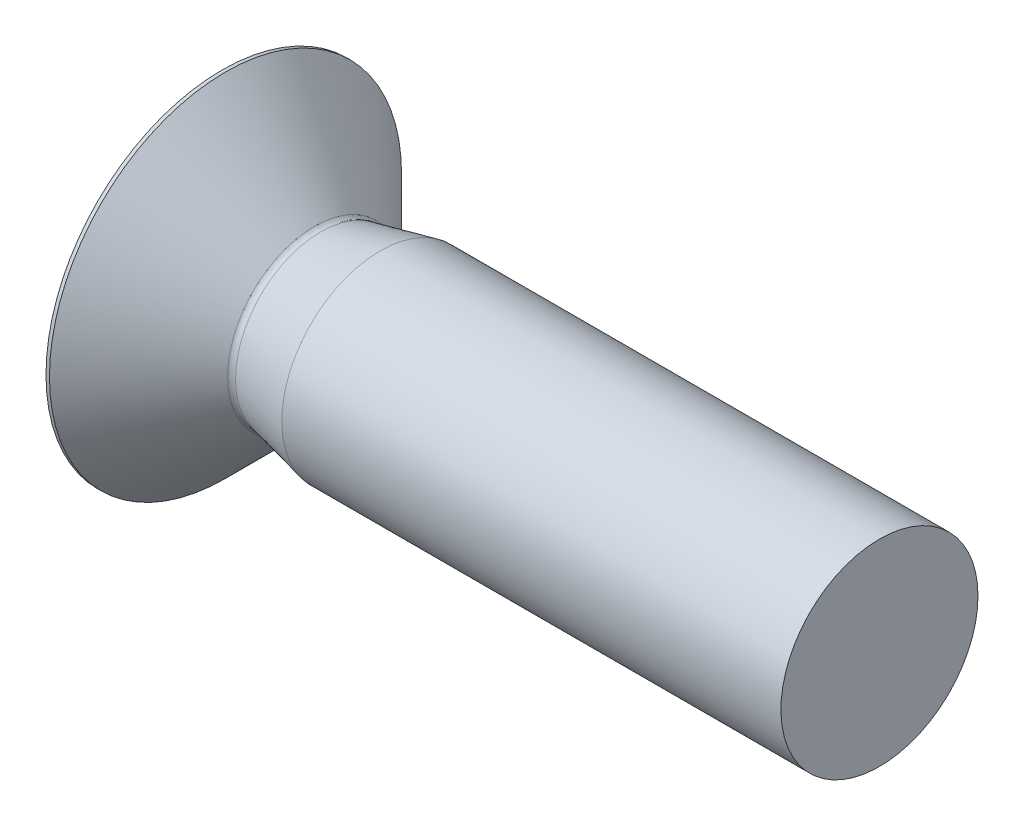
ISO-10303-21;
HEADER;
FILE_DESCRIPTION(('STEP AP214'),'2;1');
FILE_NAME('part.step','',(''),(''),'','','');
FILE_SCHEMA(('AUTOMOTIVE_DESIGN { 1 0 10303 214 1 1 1 1 }'));
ENDSEC;
DATA;
#1=APPLICATION_CONTEXT('core data for automotive mechanical design processes');
#2=APPLICATION_PROTOCOL_DEFINITION('international standard','automotive_design',2000,#1);
#3=PRODUCT_CONTEXT('',#1,'mechanical');
#4=PRODUCT('Part','Part','',(#3));
#5=PRODUCT_RELATED_PRODUCT_CATEGORY('part','',(#4));
#6=PRODUCT_DEFINITION_FORMATION('','',#4);
#7=PRODUCT_DEFINITION_CONTEXT('part definition',#1,'design');
#8=PRODUCT_DEFINITION('design','',#6,#7);
#9=PRODUCT_DEFINITION_SHAPE('','',#8);
#10=(LENGTH_UNIT() NAMED_UNIT(*) SI_UNIT(.MILLI.,.METRE.));
#11=(NAMED_UNIT(*) PLANE_ANGLE_UNIT() SI_UNIT($,.RADIAN.));
#12=(NAMED_UNIT(*) SI_UNIT($,.STERADIAN.) SOLID_ANGLE_UNIT());
#13=UNCERTAINTY_MEASURE_WITH_UNIT(LENGTH_MEASURE(1.E-05),#10,'distance_accuracy_value','');
#14=(GEOMETRIC_REPRESENTATION_CONTEXT(3) GLOBAL_UNCERTAINTY_ASSIGNED_CONTEXT((#13)) GLOBAL_UNIT_ASSIGNED_CONTEXT((#10,
#11,#12)) REPRESENTATION_CONTEXT('',''));
#15=CARTESIAN_POINT('',(0.,0.,0.));
#16=DIRECTION('',(0.,0.,1.));
#17=DIRECTION('',(1.,0.,0.));
#18=AXIS2_PLACEMENT_3D('',#15,#16,#17);
#19=CARTESIAN_POINT('',(13.1071334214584,0.,0.));
#20=DIRECTION('',(0.,0.,1.));
#21=DIRECTION('',(1.,0.,0.));
#22=AXIS2_PLACEMENT_3D('',#19,#20,#21);
#23=SPHERICAL_SURFACE('',#22,13.3871334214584);
#24=CARTESIAN_POINT('',(-0.00899944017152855,0.,0.));
#25=DIRECTION('',(1.,0.,0.));
#26=DIRECTION('',(0.,1.,0.));
#27=AXIS2_PLACEMENT_3D('',#24,#25,#26);
#28=CIRCLE('',#27,2.68);
#29=CARTESIAN_POINT('',(-0.00899944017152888,2.68,0.));
#30=VERTEX_POINT('',#29);
#31=EDGE_CURVE('E131',#30,#30,#28,.F.);
#32=ORIENTED_EDGE('',*,*,#31,.T.);
#33=EDGE_LOOP('',(#32));
#34=FACE_BOUND('',#33,.T.);
#35=CARTESIAN_POINT('',(13.1071334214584,-0.26,0.));
#36=DIRECTION('',(0.,1.,0.));
#37=DIRECTION('',(0.,0.,1.));
#38=AXIS2_PLACEMENT_3D('',#35,#36,#37);
#39=CIRCLE('',#38,13.3846083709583);
#40=CARTESIAN_POINT('',(-0.269568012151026,-0.26,0.46));
#41=VERTEX_POINT('',#40);
#42=CARTESIAN_POINT('',(-0.215301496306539,-0.26,1.28859190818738));
#43=VERTEX_POINT('',#42);
#44=EDGE_CURVE('E146',#41,#43,#39,.T.);
#45=ORIENTED_EDGE('',*,*,#44,.F.);
#46=CARTESIAN_POINT('',(-0.269568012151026,-0.26,0.46));
#47=CARTESIAN_POINT('',(-0.269954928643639,-0.259990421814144,0.448758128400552));
#48=CARTESIAN_POINT('',(-0.270308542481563,-0.260947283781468,0.437517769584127));
#49=CARTESIAN_POINT('',(-0.270940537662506,-0.264724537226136,0.41536078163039));
#50=CARTESIAN_POINT('',(-0.271218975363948,-0.267543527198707,0.404443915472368));
#51=CARTESIAN_POINT('',(-0.271692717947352,-0.274977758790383,0.38323140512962));
#52=CARTESIAN_POINT('',(-0.27188798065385,-0.27959390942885,0.372936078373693));
#53=CARTESIAN_POINT('',(-0.272189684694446,-0.290487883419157,0.353266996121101));
#54=CARTESIAN_POINT('',(-0.272296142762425,-0.296765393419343,0.343893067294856));
#55=CARTESIAN_POINT('',(-0.272417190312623,-0.310800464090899,0.326337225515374));
#56=CARTESIAN_POINT('',(-0.272431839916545,-0.318557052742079,0.318154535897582));
#57=CARTESIAN_POINT('',(-0.272369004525,-0.335334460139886,0.303204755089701));
#58=CARTESIAN_POINT('',(-0.27229150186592,-0.344355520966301,0.296437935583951));
#59=CARTESIAN_POINT('',(-0.272046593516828,-0.363402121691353,0.284514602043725));
#60=CARTESIAN_POINT('',(-0.271879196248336,-0.373427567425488,0.279357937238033));
#61=CARTESIAN_POINT('',(-0.271459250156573,-0.394197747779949,0.270801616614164));
#62=CARTESIAN_POINT('',(-0.271206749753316,-0.404942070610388,0.267400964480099));
#63=CARTESIAN_POINT('',(-0.270722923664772,-0.423125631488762,0.263288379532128));
#64=CARTESIAN_POINT('',(-0.270513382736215,-0.430451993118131,0.262055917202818));
#65=CARTESIAN_POINT('',(-0.270063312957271,-0.445184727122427,0.26041182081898));
#66=CARTESIAN_POINT('',(-0.269822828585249,-0.452590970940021,0.259999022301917));
#67=CARTESIAN_POINT('',(-0.26956801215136,-0.459999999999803,0.259999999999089));
#68=B_SPLINE_CURVE_WITH_KNOTS('',3,(#46,#47,#48,#49,#50,#51,#52,#53,#54,#55,#56,#57,#58,#59,#60,
#61,#62,#63,#64,#65,#66,#67),.UNSPECIFIED.,.F.,.F.,(4,2,2,2,2,2,2,2,2,2,4),(0.,
0.0337011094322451,0.0673768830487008,0.101069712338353,0.134756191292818,0.168420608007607,
0.202091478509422,0.23575919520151,0.269407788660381,0.291661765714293,0.313884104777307),.UNSPECIFIED.);
#69=CARTESIAN_POINT('',(-0.269568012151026,-0.46,0.26));
#70=VERTEX_POINT('',#69);
#71=EDGE_CURVE('E221',#41,#70,#68,.T.);
#72=ORIENTED_EDGE('',*,*,#71,.T.);
#73=CARTESIAN_POINT('',(13.1071334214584,0.,0.26));
#74=DIRECTION('',(0.,0.,-1.));
#75=DIRECTION('',(0.,1.,0.));
#76=AXIS2_PLACEMENT_3D('',#73,#74,#75);
#77=CIRCLE('',#76,13.3846083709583);
#78=CARTESIAN_POINT('',(-0.215301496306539,-1.28859190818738,0.26));
#79=VERTEX_POINT('',#78);
#80=EDGE_CURVE('E184',#79,#70,#77,.T.);
#81=ORIENTED_EDGE('',*,*,#80,.F.);
#82=CARTESIAN_POINT('',(12.9257750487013,1.02853444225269,0.));
#83=DIRECTION('',(-0.173648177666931,0.984807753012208,0.));
#84=DIRECTION('',(-0.984807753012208,-0.173648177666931,0.));
#85=AXIS2_PLACEMENT_3D('',#82,#83,#84);
#86=CIRCLE('',#85,13.3463316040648);
#87=CARTESIAN_POINT('',(-0.215301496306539,-1.28859190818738,-0.260000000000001));
#88=VERTEX_POINT('',#87);
#89=EDGE_CURVE('E182',#88,#79,#86,.T.);
#90=ORIENTED_EDGE('',*,*,#89,.F.);
#91=CARTESIAN_POINT('',(13.1071334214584,0.,-0.26));
#92=DIRECTION('',(0.,0.,1.));
#93=DIRECTION('',(0.,-1.,0.));
#94=AXIS2_PLACEMENT_3D('',#91,#92,#93);
#95=CIRCLE('',#94,13.3846083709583);
#96=CARTESIAN_POINT('',(-0.269568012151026,-0.46,-0.260000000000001));
#97=VERTEX_POINT('',#96);
#98=EDGE_CURVE('E185',#97,#88,#95,.T.);
#99=ORIENTED_EDGE('',*,*,#98,.F.);
#100=CARTESIAN_POINT('',(-0.269568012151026,-0.46,-0.26));
#101=CARTESIAN_POINT('',(-0.269954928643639,-0.448758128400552,-0.259990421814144));
#102=CARTESIAN_POINT('',(-0.270308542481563,-0.437517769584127,-0.260947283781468));
#103=CARTESIAN_POINT('',(-0.270940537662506,-0.41536078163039,-0.264724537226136));
#104=CARTESIAN_POINT('',(-0.271218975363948,-0.404443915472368,-0.267543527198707));
#105=CARTESIAN_POINT('',(-0.271692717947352,-0.38323140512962,-0.274977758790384));
#106=CARTESIAN_POINT('',(-0.27188798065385,-0.372936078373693,-0.279593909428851));
#107=CARTESIAN_POINT('',(-0.272189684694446,-0.353266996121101,-0.290487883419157));
#108=CARTESIAN_POINT('',(-0.272296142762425,-0.343893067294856,-0.296765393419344));
#109=CARTESIAN_POINT('',(-0.272417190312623,-0.326337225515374,-0.310800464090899));
#110=CARTESIAN_POINT('',(-0.272431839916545,-0.318154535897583,-0.31855705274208));
#111=CARTESIAN_POINT('',(-0.272369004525,-0.303204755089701,-0.335334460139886));
#112=CARTESIAN_POINT('',(-0.27229150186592,-0.296437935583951,-0.344355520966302));
#113=CARTESIAN_POINT('',(-0.272046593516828,-0.284514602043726,-0.363402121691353));
#114=CARTESIAN_POINT('',(-0.271879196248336,-0.279357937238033,-0.373427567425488));
#115=CARTESIAN_POINT('',(-0.271459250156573,-0.270801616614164,-0.39419774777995));
#116=CARTESIAN_POINT('',(-0.271206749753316,-0.267400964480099,-0.404942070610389));
#117=CARTESIAN_POINT('',(-0.270722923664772,-0.263288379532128,-0.423125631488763));
#118=CARTESIAN_POINT('',(-0.270513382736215,-0.262055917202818,-0.430451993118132));
#119=CARTESIAN_POINT('',(-0.270063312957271,-0.26041182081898,-0.445184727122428));
#120=CARTESIAN_POINT('',(-0.269822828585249,-0.259999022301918,-0.452590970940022));
#121=CARTESIAN_POINT('',(-0.26956801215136,-0.25999999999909,-0.459999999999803));
#122=B_SPLINE_CURVE_WITH_KNOTS('',3,(#100,#101,#102,#103,#104,#105,#106,#107,#108,#109,#110,
#111,#112,#113,#114,#115,#116,#117,#118,#119,#120,#121),.UNSPECIFIED.,.F.,.F.,(4,2,2,2,2,2,2,2,
2,2,4),(0.,0.0337011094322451,0.0673768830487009,0.101069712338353,0.134756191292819,
0.168420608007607,0.202091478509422,0.23575919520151,0.269407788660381,0.291661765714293,
0.313884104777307),.UNSPECIFIED.);
#123=CARTESIAN_POINT('',(-0.269568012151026,-0.26,-0.46));
#124=VERTEX_POINT('',#123);
#125=EDGE_CURVE('E229',#97,#124,#122,.T.);
#126=ORIENTED_EDGE('',*,*,#125,.T.);
#127=CARTESIAN_POINT('',(13.1071334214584,-0.26,0.));
#128=DIRECTION('',(0.,1.,0.));
#129=DIRECTION('',(0.,0.,1.));
#130=AXIS2_PLACEMENT_3D('',#127,#128,#129);
#131=CIRCLE('',#130,13.3846083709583);
#132=CARTESIAN_POINT('',(-0.215301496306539,-0.26,-1.28859190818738));
#133=VERTEX_POINT('',#132);
#134=EDGE_CURVE('E161',#133,#124,#131,.T.);
#135=ORIENTED_EDGE('',*,*,#134,.F.);
#136=CARTESIAN_POINT('',(12.9257750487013,0.,1.02853444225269));
#137=DIRECTION('',(-0.173648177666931,0.,0.984807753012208));
#138=DIRECTION('',(0.984807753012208,0.,0.173648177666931));
#139=AXIS2_PLACEMENT_3D('',#136,#137,#138);
#140=CIRCLE('',#139,13.3463316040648);
#141=CARTESIAN_POINT('',(-0.215301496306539,0.26,-1.28859190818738));
#142=VERTEX_POINT('',#141);
#143=EDGE_CURVE('E159',#142,#133,#140,.T.);
#144=ORIENTED_EDGE('',*,*,#143,.F.);
#145=CARTESIAN_POINT('',(13.1071334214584,0.26,0.));
#146=DIRECTION('',(0.,-1.,0.));
#147=DIRECTION('',(0.,0.,-1.));
#148=AXIS2_PLACEMENT_3D('',#145,#146,#147);
#149=CIRCLE('',#148,13.3846083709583);
#150=CARTESIAN_POINT('',(-0.269568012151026,0.26,-0.46));
#151=VERTEX_POINT('',#150);
#152=EDGE_CURVE('E162',#151,#142,#149,.T.);
#153=ORIENTED_EDGE('',*,*,#152,.F.);
#154=CARTESIAN_POINT('',(-0.269568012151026,0.26,-0.46));
#155=CARTESIAN_POINT('',(-0.269954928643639,0.259990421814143,-0.448758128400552));
#156=CARTESIAN_POINT('',(-0.270308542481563,0.260947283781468,-0.437517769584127));
#157=CARTESIAN_POINT('',(-0.270940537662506,0.264724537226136,-0.41536078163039));
#158=CARTESIAN_POINT('',(-0.271218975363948,0.267543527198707,-0.404443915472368));
#159=CARTESIAN_POINT('',(-0.271692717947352,0.274977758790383,-0.38323140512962));
#160=CARTESIAN_POINT('',(-0.27188798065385,0.27959390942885,-0.372936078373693));
#161=CARTESIAN_POINT('',(-0.272189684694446,0.290487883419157,-0.353266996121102));
#162=CARTESIAN_POINT('',(-0.272296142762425,0.296765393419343,-0.343893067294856));
#163=CARTESIAN_POINT('',(-0.272417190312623,0.310800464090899,-0.326337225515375));
#164=CARTESIAN_POINT('',(-0.272431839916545,0.31855705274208,-0.318154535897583));
#165=CARTESIAN_POINT('',(-0.272369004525,0.335334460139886,-0.303204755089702));
#166=CARTESIAN_POINT('',(-0.27229150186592,0.344355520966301,-0.296437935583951));
#167=CARTESIAN_POINT('',(-0.272046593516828,0.363402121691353,-0.284514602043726));
#168=CARTESIAN_POINT('',(-0.271879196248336,0.373427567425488,-0.279357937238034));
#169=CARTESIAN_POINT('',(-0.271459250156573,0.39419774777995,-0.270801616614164));
#170=CARTESIAN_POINT('',(-0.271206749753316,0.404942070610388,-0.267400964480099));
#171=CARTESIAN_POINT('',(-0.270722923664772,0.423125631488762,-0.263288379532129));
#172=CARTESIAN_POINT('',(-0.270513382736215,0.430451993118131,-0.262055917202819));
#173=CARTESIAN_POINT('',(-0.270063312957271,0.445184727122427,-0.260411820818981));
#174=CARTESIAN_POINT('',(-0.26982282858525,0.452590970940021,-0.259999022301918));
#175=CARTESIAN_POINT('',(-0.26956801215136,0.459999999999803,-0.25999999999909));
#176=B_SPLINE_CURVE_WITH_KNOTS('',3,(#154,#155,#156,#157,#158,#159,#160,#161,#162,#163,#164,
#165,#166,#167,#168,#169,#170,#171,#172,#173,#174,#175),.UNSPECIFIED.,.F.,.F.,(4,2,2,2,2,2,2,2,
2,2,4),(0.,0.0337011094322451,0.0673768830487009,0.101069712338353,0.134756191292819,
0.168420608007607,0.202091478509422,0.23575919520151,0.269407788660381,0.291661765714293,
0.313884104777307),.UNSPECIFIED.);
#177=CARTESIAN_POINT('',(-0.269568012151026,0.46,-0.26));
#178=VERTEX_POINT('',#177);
#179=EDGE_CURVE('E246',#151,#178,#176,.T.);
#180=ORIENTED_EDGE('',*,*,#179,.T.);
#181=CARTESIAN_POINT('',(13.1071334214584,0.,-0.260000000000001));
#182=DIRECTION('',(0.,0.,1.));
#183=DIRECTION('',(0.,-1.,0.));
#184=AXIS2_PLACEMENT_3D('',#181,#182,#183);
#185=CIRCLE('',#184,13.3846083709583);
#186=CARTESIAN_POINT('',(-0.215301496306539,1.28859190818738,-0.26));
#187=VERTEX_POINT('',#186);
#188=EDGE_CURVE('E173',#187,#178,#185,.T.);
#189=ORIENTED_EDGE('',*,*,#188,.F.);
#190=CARTESIAN_POINT('',(12.9257750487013,-1.02853444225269,0.));
#191=DIRECTION('',(-0.173648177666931,-0.984807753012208,0.));
#192=DIRECTION('',(0.984807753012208,-0.173648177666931,0.));
#193=AXIS2_PLACEMENT_3D('',#190,#191,#192);
#194=CIRCLE('',#193,13.3463316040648);
#195=CARTESIAN_POINT('',(-0.215301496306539,1.28859190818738,0.26));
#196=VERTEX_POINT('',#195);
#197=EDGE_CURVE('E171',#196,#187,#194,.T.);
#198=ORIENTED_EDGE('',*,*,#197,.F.);
#199=CARTESIAN_POINT('',(13.1071334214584,0.,0.26));
#200=DIRECTION('',(0.,0.,-1.));
#201=DIRECTION('',(0.,1.,0.));
#202=AXIS2_PLACEMENT_3D('',#199,#200,#201);
#203=CIRCLE('',#202,13.3846083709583);
#204=CARTESIAN_POINT('',(-0.269568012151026,0.46,0.26));
#205=VERTEX_POINT('',#204);
#206=EDGE_CURVE('E187',#205,#196,#203,.T.);
#207=ORIENTED_EDGE('',*,*,#206,.F.);
#208=CARTESIAN_POINT('',(-0.269568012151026,0.46,0.26));
#209=CARTESIAN_POINT('',(-0.269954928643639,0.448758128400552,0.259990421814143));
#210=CARTESIAN_POINT('',(-0.270308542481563,0.437517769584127,0.260947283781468));
#211=CARTESIAN_POINT('',(-0.270940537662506,0.41536078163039,0.264724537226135));
#212=CARTESIAN_POINT('',(-0.271218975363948,0.404443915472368,0.267543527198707));
#213=CARTESIAN_POINT('',(-0.271692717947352,0.38323140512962,0.274977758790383));
#214=CARTESIAN_POINT('',(-0.27188798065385,0.372936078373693,0.27959390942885));
#215=CARTESIAN_POINT('',(-0.272189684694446,0.353266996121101,0.290487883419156));
#216=CARTESIAN_POINT('',(-0.272296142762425,0.343893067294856,0.296765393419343));
#217=CARTESIAN_POINT('',(-0.272417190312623,0.326337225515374,0.310800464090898));
#218=CARTESIAN_POINT('',(-0.272431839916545,0.318154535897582,0.318557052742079));
#219=CARTESIAN_POINT('',(-0.272369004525,0.303204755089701,0.335334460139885));
#220=CARTESIAN_POINT('',(-0.27229150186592,0.296437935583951,0.344355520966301));
#221=CARTESIAN_POINT('',(-0.272046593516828,0.284514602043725,0.363402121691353));
#222=CARTESIAN_POINT('',(-0.271879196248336,0.279357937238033,0.373427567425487));
#223=CARTESIAN_POINT('',(-0.271459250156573,0.270801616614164,0.394197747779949));
#224=CARTESIAN_POINT('',(-0.271206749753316,0.267400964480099,0.404942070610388));
#225=CARTESIAN_POINT('',(-0.270722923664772,0.263288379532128,0.423125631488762));
#226=CARTESIAN_POINT('',(-0.270513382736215,0.262055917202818,0.430451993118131));
#227=CARTESIAN_POINT('',(-0.270063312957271,0.26041182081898,0.445184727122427));
#228=CARTESIAN_POINT('',(-0.269822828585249,0.259999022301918,0.452590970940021));
#229=CARTESIAN_POINT('',(-0.26956801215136,0.25999999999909,0.459999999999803));
#230=B_SPLINE_CURVE_WITH_KNOTS('',3,(#208,#209,#210,#211,#212,#213,#214,#215,#216,#217,#218,
#219,#220,#221,#222,#223,#224,#225,#226,#227,#228,#229),.UNSPECIFIED.,.F.,.F.,(4,2,2,2,2,2,2,2,
2,2,4),(0.,0.0337011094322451,0.0673768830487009,0.101069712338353,0.134756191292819,
0.168420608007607,0.202091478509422,0.23575919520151,0.269407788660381,0.291661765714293,
0.313884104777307),.UNSPECIFIED.);
#231=CARTESIAN_POINT('',(-0.269568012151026,0.26,0.46));
#232=VERTEX_POINT('',#231);
#233=EDGE_CURVE('E253',#205,#232,#230,.T.);
#234=ORIENTED_EDGE('',*,*,#233,.T.);
#235=CARTESIAN_POINT('',(13.1071334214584,0.26,0.));
#236=DIRECTION('',(0.,-1.,0.));
#237=DIRECTION('',(0.,0.,-1.));
#238=AXIS2_PLACEMENT_3D('',#235,#236,#237);
#239=CIRCLE('',#238,13.3846083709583);
#240=CARTESIAN_POINT('',(-0.215301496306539,0.26,1.28859190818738));
#241=VERTEX_POINT('',#240);
#242=EDGE_CURVE('E145',#241,#232,#239,.T.);
#243=ORIENTED_EDGE('',*,*,#242,.F.);
#244=CARTESIAN_POINT('',(12.9257750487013,0.,-1.02853444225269));
#245=DIRECTION('',(-0.173648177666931,0.,-0.984807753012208));
#246=DIRECTION('',(-0.984807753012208,0.,0.173648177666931));
#247=AXIS2_PLACEMENT_3D('',#244,#245,#246);
#248=CIRCLE('',#247,13.3463316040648);
#249=EDGE_CURVE('E130',#43,#241,#248,.T.);
#250=ORIENTED_EDGE('',*,*,#249,.F.);
#251=EDGE_LOOP('',(#45,#72,#81,#90,#99,#126,#135,#144,#153,#180,#189,#198,#207,#234,#243,#250));
#252=FACE_BOUND('',#251,.T.);
#253=ADVANCED_FACE('F38',(#34,#252),#23,.T.);
#254=CARTESIAN_POINT('',(1.4,0.,0.));
#255=DIRECTION('',(-1.,0.,0.));
#256=DIRECTION('',(0.,1.,0.));
#257=AXIS2_PLACEMENT_3D('',#254,#255,#256);
#258=CONICAL_SURFACE('',#257,1.32367301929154,0.78539816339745);
#259=CARTESIAN_POINT('',(0.0436730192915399,0.,0.));
#260=DIRECTION('',(-1.,0.,0.));
#261=DIRECTION('',(0.,0.,1.));
#262=AXIS2_PLACEMENT_3D('',#259,#260,#261);
#263=CIRCLE('',#262,2.68);
#264=CARTESIAN_POINT('',(0.0436730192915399,0.,2.68));
#265=VERTEX_POINT('',#264);
#266=EDGE_CURVE('E332',#265,#265,#263,.F.);
#267=ORIENTED_EDGE('',*,*,#266,.T.);
#268=EDGE_LOOP('',(#267));
#269=FACE_BOUND('',#268,.T.);
#270=CARTESIAN_POINT('',(1.4,0.,0.));
#271=DIRECTION('',(-1.,0.,0.));
#272=DIRECTION('',(0.,0.,1.));
#273=AXIS2_PLACEMENT_3D('',#270,#271,#272);
#274=CIRCLE('',#273,1.32367301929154);
#275=CARTESIAN_POINT('',(1.4,0.,1.32367301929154));
#276=VERTEX_POINT('',#275);
#277=EDGE_CURVE('E421',#276,#276,#274,.T.);
#278=ORIENTED_EDGE('',*,*,#277,.T.);
#279=EDGE_LOOP('',(#278));
#280=FACE_BOUND('',#279,.T.);
#281=ADVANCED_FACE('F240',(#269,#280),#258,.T.);
#282=CARTESIAN_POINT('',(10.,0.,0.));
#283=DIRECTION('',(1.,0.,0.));
#284=DIRECTION('',(0.,1.,0.));
#285=AXIS2_PLACEMENT_3D('',#282,#283,#284);
#286=CYLINDRICAL_SURFACE('',#285,2.68);
#287=ORIENTED_EDGE('',*,*,#31,.F.);
#288=EDGE_LOOP('',(#287));
#289=FACE_BOUND('',#288,.T.);
#290=ORIENTED_EDGE('',*,*,#266,.F.);
#291=EDGE_LOOP('',(#290));
#292=FACE_BOUND('',#291,.T.);
#293=ADVANCED_FACE('F398',(#289,#292),#286,.T.);
#294=CARTESIAN_POINT('',(1.12,1.3,0.26));
#295=DIRECTION('',(0.,0.,-1.));
#296=DIRECTION('',(0.,1.,0.));
#297=AXIS2_PLACEMENT_3D('',#294,#295,#296);
#298=PLANE('',#297);
#299=DIRECTION('',(0.,-1.,0.));
#300=VECTOR('',#299,1.);
#301=CARTESIAN_POINT('',(1.12,1.3,0.26));
#302=LINE('',#301,#300);
#303=CARTESIAN_POINT('',(1.12,1.05314222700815,0.26));
#304=VERTEX_POINT('',#303);
#305=CARTESIAN_POINT('',(1.12,0.46,0.26));
#306=VERTEX_POINT('',#305);
#307=EDGE_CURVE('E122',#304,#306,#302,.T.);
#308=ORIENTED_EDGE('',*,*,#307,.T.);
#309=DIRECTION('',(-1.,0.,0.));
#310=VECTOR('',#309,1.);
#311=CARTESIAN_POINT('',(1.12,0.46,0.26));
#312=LINE('',#311,#310);
#313=EDGE_CURVE('E209',#306,#205,#312,.T.);
#314=ORIENTED_EDGE('',*,*,#313,.T.);
#315=ORIENTED_EDGE('',*,*,#206,.T.);
#316=DIRECTION('',(-0.984807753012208,0.173648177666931,0.));
#317=VECTOR('',#316,1.);
#318=CARTESIAN_POINT('',(1.07778483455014,1.06058589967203,0.26));
#319=LINE('',#318,#317);
#320=EDGE_CURVE('E165',#304,#196,#319,.T.);
#321=ORIENTED_EDGE('',*,*,#320,.F.);
#322=EDGE_LOOP('',(#308,#314,#315,#321));
#323=FACE_BOUND('',#322,.T.);
#324=ADVANCED_FACE('F365',(#323),#298,.T.);
#325=CARTESIAN_POINT('',(1.12,0.26,1.3));
#326=DIRECTION('',(0.,-1.,0.));
#327=DIRECTION('',(0.,0.,-1.));
#328=AXIS2_PLACEMENT_3D('',#325,#326,#327);
#329=PLANE('',#328);
#330=ORIENTED_EDGE('',*,*,#242,.T.);
#331=DIRECTION('',(-1.,0.,0.));
#332=VECTOR('',#331,1.);
#333=CARTESIAN_POINT('',(1.12,0.26,0.46));
#334=LINE('',#333,#332);
#335=CARTESIAN_POINT('',(1.12,0.26,0.46));
#336=VERTEX_POINT('',#335);
#337=EDGE_CURVE('E116',#232,#336,#334,.F.);
#338=ORIENTED_EDGE('',*,*,#337,.T.);
#339=DIRECTION('',(0.,0.,1.));
#340=VECTOR('',#339,1.);
#341=CARTESIAN_POINT('',(1.12,0.26,1.3));
#342=LINE('',#341,#340);
#343=CARTESIAN_POINT('',(1.12,0.26,1.05314222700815));
#344=VERTEX_POINT('',#343);
#345=EDGE_CURVE('E110',#336,#344,#342,.T.);
#346=ORIENTED_EDGE('',*,*,#345,.T.);
#347=DIRECTION('',(-0.984807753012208,0.,0.173648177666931));
#348=VECTOR('',#347,1.);
#349=CARTESIAN_POINT('',(-0.28,0.26,1.3));
#350=LINE('',#349,#348);
#351=EDGE_CURVE('E42',#344,#241,#350,.T.);
#352=ORIENTED_EDGE('',*,*,#351,.T.);
#353=EDGE_LOOP('',(#330,#338,#346,#352));
#354=FACE_BOUND('',#353,.T.);
#355=ADVANCED_FACE('F113',(#354),#329,.T.);
#356=CARTESIAN_POINT('',(-0.28,0.,1.3));
#357=DIRECTION('',(-0.173648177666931,0.,-0.984807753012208));
#358=DIRECTION('',(-0.984807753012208,0.,0.173648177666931));
#359=AXIS2_PLACEMENT_3D('',#356,#357,#358);
#360=PLANE('',#359);
#361=ORIENTED_EDGE('',*,*,#249,.T.);
#362=ORIENTED_EDGE('',*,*,#351,.F.);
#363=DIRECTION('',(0.,-1.,0.));
#364=VECTOR('',#363,1.);
#365=CARTESIAN_POINT('',(1.12,0.,1.05314222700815));
#366=LINE('',#365,#364);
#367=CARTESIAN_POINT('',(1.12,-0.26,1.05314222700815));
#368=VERTEX_POINT('',#367);
#369=EDGE_CURVE('E121',#344,#368,#366,.T.);
#370=ORIENTED_EDGE('',*,*,#369,.T.);
#371=DIRECTION('',(-0.984807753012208,0.,0.173648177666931));
#372=VECTOR('',#371,1.);
#373=CARTESIAN_POINT('',(1.07778483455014,-0.26,1.06058589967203));
#374=LINE('',#373,#372);
#375=EDGE_CURVE('E132',#368,#43,#374,.T.);
#376=ORIENTED_EDGE('',*,*,#375,.T.);
#377=EDGE_LOOP('',(#361,#362,#370,#376));
#378=FACE_BOUND('',#377,.T.);
#379=ADVANCED_FACE('F126',(#378),#360,.T.);
#380=CARTESIAN_POINT('',(1.12,-0.26,1.3));
#381=DIRECTION('',(0.,1.,0.));
#382=DIRECTION('',(0.,0.,1.));
#383=AXIS2_PLACEMENT_3D('',#380,#381,#382);
#384=PLANE('',#383);
#385=DIRECTION('',(0.,0.,-1.));
#386=VECTOR('',#385,1.);
#387=CARTESIAN_POINT('',(1.12,-0.26,1.3));
#388=LINE('',#387,#386);
#389=CARTESIAN_POINT('',(1.12,-0.26,0.46));
#390=VERTEX_POINT('',#389);
#391=EDGE_CURVE('E138',#368,#390,#388,.T.);
#392=ORIENTED_EDGE('',*,*,#391,.T.);
#393=DIRECTION('',(-1.,0.,0.));
#394=VECTOR('',#393,1.);
#395=CARTESIAN_POINT('',(1.12,-0.26,0.46));
#396=LINE('',#395,#394);
#397=EDGE_CURVE('E194',#390,#41,#396,.T.);
#398=ORIENTED_EDGE('',*,*,#397,.T.);
#399=ORIENTED_EDGE('',*,*,#44,.T.);
#400=ORIENTED_EDGE('',*,*,#375,.F.);
#401=EDGE_LOOP('',(#392,#398,#399,#400));
#402=FACE_BOUND('',#401,.T.);
#403=ADVANCED_FACE('F278',(#402),#384,.T.);
#404=CARTESIAN_POINT('',(1.12,-0.26,0.26));
#405=DIRECTION('',(0.,0.,-1.));
#406=DIRECTION('',(0.,1.,0.));
#407=AXIS2_PLACEMENT_3D('',#404,#405,#406);
#408=PLANE('',#407);
#409=ORIENTED_EDGE('',*,*,#80,.T.);
#410=DIRECTION('',(-1.,0.,0.));
#411=VECTOR('',#410,1.);
#412=CARTESIAN_POINT('',(1.12,-0.46,0.26));
#413=LINE('',#412,#411);
#414=CARTESIAN_POINT('',(1.12,-0.46,0.26));
#415=VERTEX_POINT('',#414);
#416=EDGE_CURVE('E218',#70,#415,#413,.F.);
#417=ORIENTED_EDGE('',*,*,#416,.T.);
#418=DIRECTION('',(0.,-1.,0.));
#419=VECTOR('',#418,1.);
#420=CARTESIAN_POINT('',(1.12,-0.26,0.26));
#421=LINE('',#420,#419);
#422=CARTESIAN_POINT('',(1.12,-1.05314222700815,0.26));
#423=VERTEX_POINT('',#422);
#424=EDGE_CURVE('E139',#415,#423,#421,.T.);
#425=ORIENTED_EDGE('',*,*,#424,.T.);
#426=DIRECTION('',(-0.984807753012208,-0.173648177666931,0.));
#427=VECTOR('',#426,1.);
#428=CARTESIAN_POINT('',(-0.28,-1.3,0.26));
#429=LINE('',#428,#427);
#430=EDGE_CURVE('E143',#423,#79,#429,.T.);
#431=ORIENTED_EDGE('',*,*,#430,.T.);
#432=EDGE_LOOP('',(#409,#417,#425,#431));
#433=FACE_BOUND('',#432,.T.);
#434=ADVANCED_FACE('F275',(#433),#408,.T.);
#435=CARTESIAN_POINT('',(-0.28,-1.3,0.));
#436=DIRECTION('',(-0.173648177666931,0.984807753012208,0.));
#437=DIRECTION('',(-0.984807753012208,-0.173648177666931,0.));
#438=AXIS2_PLACEMENT_3D('',#435,#436,#437);
#439=PLANE('',#438);
#440=ORIENTED_EDGE('',*,*,#89,.T.);
#441=ORIENTED_EDGE('',*,*,#430,.F.);
#442=DIRECTION('',(0.,0.,-1.));
#443=VECTOR('',#442,1.);
#444=CARTESIAN_POINT('',(1.12,-1.05314222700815,0.));
#445=LINE('',#444,#443);
#446=CARTESIAN_POINT('',(1.12,-1.05314222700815,-0.260000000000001));
#447=VERTEX_POINT('',#446);
#448=EDGE_CURVE('E177',#423,#447,#445,.T.);
#449=ORIENTED_EDGE('',*,*,#448,.T.);
#450=DIRECTION('',(-0.984807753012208,-0.173648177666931,0.));
#451=VECTOR('',#450,1.);
#452=CARTESIAN_POINT('',(1.25563530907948,-1.0292260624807,-0.260000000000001));
#453=LINE('',#452,#451);
#454=EDGE_CURVE('E150',#447,#88,#453,.T.);
#455=ORIENTED_EDGE('',*,*,#454,.T.);
#456=EDGE_LOOP('',(#440,#441,#449,#455));
#457=FACE_BOUND('',#456,.T.);
#458=ADVANCED_FACE('F271',(#457),#439,.T.);
#459=CARTESIAN_POINT('',(1.12,-0.26,-0.26));
#460=DIRECTION('',(0.,0.,1.));
#461=DIRECTION('',(0.,-1.,0.));
#462=AXIS2_PLACEMENT_3D('',#459,#460,#461);
#463=PLANE('',#462);
#464=DIRECTION('',(0.,1.,0.));
#465=VECTOR('',#464,1.);
#466=CARTESIAN_POINT('',(1.12,-0.26,-0.26));
#467=LINE('',#466,#465);
#468=CARTESIAN_POINT('',(1.12,-0.46,-0.26));
#469=VERTEX_POINT('',#468);
#470=EDGE_CURVE('E179',#447,#469,#467,.T.);
#471=ORIENTED_EDGE('',*,*,#470,.T.);
#472=DIRECTION('',(-1.,0.,0.));
#473=VECTOR('',#472,1.);
#474=CARTESIAN_POINT('',(1.12,-0.46,-0.26));
#475=LINE('',#474,#473);
#476=EDGE_CURVE('E215',#469,#97,#475,.T.);
#477=ORIENTED_EDGE('',*,*,#476,.T.);
#478=ORIENTED_EDGE('',*,*,#98,.T.);
#479=ORIENTED_EDGE('',*,*,#454,.F.);
#480=EDGE_LOOP('',(#471,#477,#478,#479));
#481=FACE_BOUND('',#480,.T.);
#482=ADVANCED_FACE('F274',(#481),#463,.T.);
#483=CARTESIAN_POINT('',(1.12,-0.26,-0.26));
#484=DIRECTION('',(0.,1.,0.));
#485=DIRECTION('',(0.,0.,1.));
#486=AXIS2_PLACEMENT_3D('',#483,#484,#485);
#487=PLANE('',#486);
#488=ORIENTED_EDGE('',*,*,#134,.T.);
#489=DIRECTION('',(-1.,0.,0.));
#490=VECTOR('',#489,1.);
#491=CARTESIAN_POINT('',(1.12,-0.26,-0.46));
#492=LINE('',#491,#490);
#493=CARTESIAN_POINT('',(1.12,-0.26,-0.46));
#494=VERTEX_POINT('',#493);
#495=EDGE_CURVE('E212',#124,#494,#492,.F.);
#496=ORIENTED_EDGE('',*,*,#495,.T.);
#497=DIRECTION('',(0.,0.,-1.));
#498=VECTOR('',#497,1.);
#499=CARTESIAN_POINT('',(1.12,-0.26,-0.26));
#500=LINE('',#499,#498);
#501=CARTESIAN_POINT('',(1.12,-0.26,-1.05314222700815));
#502=VERTEX_POINT('',#501);
#503=EDGE_CURVE('E155',#494,#502,#500,.T.);
#504=ORIENTED_EDGE('',*,*,#503,.T.);
#505=DIRECTION('',(-0.984807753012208,0.,-0.173648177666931));
#506=VECTOR('',#505,1.);
#507=CARTESIAN_POINT('',(-0.28,-0.26,-1.3));
#508=LINE('',#507,#506);
#509=EDGE_CURVE('E147',#502,#133,#508,.T.);
#510=ORIENTED_EDGE('',*,*,#509,.T.);
#511=EDGE_LOOP('',(#488,#496,#504,#510));
#512=FACE_BOUND('',#511,.T.);
#513=ADVANCED_FACE('F282',(#512),#487,.T.);
#514=CARTESIAN_POINT('',(-0.28,0.,-1.3));
#515=DIRECTION('',(-0.173648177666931,0.,0.984807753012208));
#516=DIRECTION('',(0.984807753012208,0.,0.173648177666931));
#517=AXIS2_PLACEMENT_3D('',#514,#515,#516);
#518=PLANE('',#517);
#519=ORIENTED_EDGE('',*,*,#143,.T.);
#520=ORIENTED_EDGE('',*,*,#509,.F.);
#521=DIRECTION('',(0.,1.,0.));
#522=VECTOR('',#521,1.);
#523=CARTESIAN_POINT('',(1.12,0.,-1.05314222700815));
#524=LINE('',#523,#522);
#525=CARTESIAN_POINT('',(1.12,0.26,-1.05314222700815));
#526=VERTEX_POINT('',#525);
#527=EDGE_CURVE('E152',#502,#526,#524,.T.);
#528=ORIENTED_EDGE('',*,*,#527,.T.);
#529=DIRECTION('',(-0.984807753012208,0.,-0.173648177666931));
#530=VECTOR('',#529,1.);
#531=CARTESIAN_POINT('',(1.25563530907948,0.26,-1.0292260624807));
#532=LINE('',#531,#530);
#533=EDGE_CURVE('E151',#526,#142,#532,.T.);
#534=ORIENTED_EDGE('',*,*,#533,.T.);
#535=EDGE_LOOP('',(#519,#520,#528,#534));
#536=FACE_BOUND('',#535,.T.);
#537=ADVANCED_FACE('F279',(#536),#518,.T.);
#538=CARTESIAN_POINT('',(1.12,0.26,-0.26));
#539=DIRECTION('',(0.,-1.,0.));
#540=DIRECTION('',(0.,0.,-1.));
#541=AXIS2_PLACEMENT_3D('',#538,#539,#540);
#542=PLANE('',#541);
#543=DIRECTION('',(0.,0.,1.));
#544=VECTOR('',#543,1.);
#545=CARTESIAN_POINT('',(1.12,0.26,-0.26));
#546=LINE('',#545,#544);
#547=CARTESIAN_POINT('',(1.12,0.26,-0.46));
#548=VERTEX_POINT('',#547);
#549=EDGE_CURVE('E154',#526,#548,#546,.T.);
#550=ORIENTED_EDGE('',*,*,#549,.T.);
#551=DIRECTION('',(-1.,0.,0.));
#552=VECTOR('',#551,1.);
#553=CARTESIAN_POINT('',(1.12,0.26,-0.46));
#554=LINE('',#553,#552);
#555=EDGE_CURVE('E205',#548,#151,#554,.T.);
#556=ORIENTED_EDGE('',*,*,#555,.T.);
#557=ORIENTED_EDGE('',*,*,#152,.T.);
#558=ORIENTED_EDGE('',*,*,#533,.F.);
#559=EDGE_LOOP('',(#550,#556,#557,#558));
#560=FACE_BOUND('',#559,.T.);
#561=ADVANCED_FACE('F281',(#560),#542,.T.);
#562=CARTESIAN_POINT('',(1.12,1.3,-0.26));
#563=DIRECTION('',(0.,0.,1.));
#564=DIRECTION('',(0.,-1.,0.));
#565=AXIS2_PLACEMENT_3D('',#562,#563,#564);
#566=PLANE('',#565);
#567=ORIENTED_EDGE('',*,*,#188,.T.);
#568=DIRECTION('',(-1.,0.,0.));
#569=VECTOR('',#568,1.);
#570=CARTESIAN_POINT('',(1.12,0.46,-0.26));
#571=LINE('',#570,#569);
#572=CARTESIAN_POINT('',(1.12,0.46,-0.26));
#573=VERTEX_POINT('',#572);
#574=EDGE_CURVE('E57',#178,#573,#571,.F.);
#575=ORIENTED_EDGE('',*,*,#574,.T.);
#576=DIRECTION('',(0.,1.,0.));
#577=VECTOR('',#576,1.);
#578=CARTESIAN_POINT('',(1.12,1.3,-0.26));
#579=LINE('',#578,#577);
#580=CARTESIAN_POINT('',(1.12,1.05314222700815,-0.26));
#581=VERTEX_POINT('',#580);
#582=EDGE_CURVE('E168',#573,#581,#579,.T.);
#583=ORIENTED_EDGE('',*,*,#582,.T.);
#584=DIRECTION('',(-0.984807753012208,0.173648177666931,0.));
#585=VECTOR('',#584,1.);
#586=CARTESIAN_POINT('',(-0.28,1.3,-0.26));
#587=LINE('',#586,#585);
#588=EDGE_CURVE('E158',#581,#187,#587,.T.);
#589=ORIENTED_EDGE('',*,*,#588,.T.);
#590=EDGE_LOOP('',(#567,#575,#583,#589));
#591=FACE_BOUND('',#590,.T.);
#592=ADVANCED_FACE('F288',(#591),#566,.T.);
#593=CARTESIAN_POINT('',(-0.28,1.3,0.));
#594=DIRECTION('',(-0.173648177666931,-0.984807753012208,0.));
#595=DIRECTION('',(0.984807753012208,-0.173648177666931,0.));
#596=AXIS2_PLACEMENT_3D('',#593,#594,#595);
#597=PLANE('',#596);
#598=ORIENTED_EDGE('',*,*,#197,.T.);
#599=ORIENTED_EDGE('',*,*,#588,.F.);
#600=DIRECTION('',(0.,0.,1.));
#601=VECTOR('',#600,1.);
#602=CARTESIAN_POINT('',(1.12,1.05314222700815,0.));
#603=LINE('',#602,#601);
#604=EDGE_CURVE('E166',#581,#304,#603,.T.);
#605=ORIENTED_EDGE('',*,*,#604,.T.);
#606=ORIENTED_EDGE('',*,*,#320,.T.);
#607=EDGE_LOOP('',(#598,#599,#605,#606));
#608=FACE_BOUND('',#607,.T.);
#609=ADVANCED_FACE('F40',(#608),#597,.T.);
#610=CARTESIAN_POINT('',(1.12,0.26,0.26));
#611=DIRECTION('',(1.,0.,0.));
#612=DIRECTION('',(0.,0.,-1.));
#613=AXIS2_PLACEMENT_3D('',#610,#611,#612);
#614=PLANE('',#613);
#615=ORIENTED_EDGE('',*,*,#307,.F.);
#616=ORIENTED_EDGE('',*,*,#604,.F.);
#617=ORIENTED_EDGE('',*,*,#582,.F.);
#618=CARTESIAN_POINT('',(1.12,0.46,-0.46));
#619=DIRECTION('',(1.,0.,0.));
#620=DIRECTION('',(0.,0.,-1.));
#621=AXIS2_PLACEMENT_3D('',#618,#619,#620);
#622=CIRCLE('',#621,0.2);
#623=EDGE_CURVE('E11',#573,#548,#622,.T.);
#624=ORIENTED_EDGE('',*,*,#623,.T.);
#625=ORIENTED_EDGE('',*,*,#549,.F.);
#626=ORIENTED_EDGE('',*,*,#527,.F.);
#627=ORIENTED_EDGE('',*,*,#503,.F.);
#628=CARTESIAN_POINT('',(1.12,-0.46,-0.46));
#629=DIRECTION('',(1.,0.,0.));
#630=DIRECTION('',(0.,0.,-1.));
#631=AXIS2_PLACEMENT_3D('',#628,#629,#630);
#632=CIRCLE('',#631,0.2);
#633=EDGE_CURVE('E199',#494,#469,#632,.T.);
#634=ORIENTED_EDGE('',*,*,#633,.T.);
#635=ORIENTED_EDGE('',*,*,#470,.F.);
#636=ORIENTED_EDGE('',*,*,#448,.F.);
#637=ORIENTED_EDGE('',*,*,#424,.F.);
#638=CARTESIAN_POINT('',(1.12,-0.46,0.46));
#639=DIRECTION('',(1.,0.,0.));
#640=DIRECTION('',(0.,0.,-1.));
#641=AXIS2_PLACEMENT_3D('',#638,#639,#640);
#642=CIRCLE('',#641,0.2);
#643=EDGE_CURVE('E202',#415,#390,#642,.T.);
#644=ORIENTED_EDGE('',*,*,#643,.T.);
#645=ORIENTED_EDGE('',*,*,#391,.F.);
#646=ORIENTED_EDGE('',*,*,#369,.F.);
#647=ORIENTED_EDGE('',*,*,#345,.F.);
#648=CARTESIAN_POINT('',(1.12,0.46,0.46));
#649=DIRECTION('',(1.,0.,0.));
#650=DIRECTION('',(0.,0.,-1.));
#651=AXIS2_PLACEMENT_3D('',#648,#649,#650);
#652=CIRCLE('',#651,0.2);
#653=EDGE_CURVE('E48',#336,#306,#652,.T.);
#654=ORIENTED_EDGE('',*,*,#653,.T.);
#655=EDGE_LOOP('',(#615,#616,#617,#624,#625,#626,#627,#634,#635,#636,#637,#644,#645,#646,#647,#654));
#656=FACE_BOUND('',#655,.T.);
#657=ADVANCED_FACE('F135',(#656),#614,.F.);
#658=CARTESIAN_POINT('',(1.12,-0.46,0.46));
#659=DIRECTION('',(-1.,0.,0.));
#660=DIRECTION('',(0.,0.,1.));
#661=AXIS2_PLACEMENT_3D('',#658,#659,#660);
#662=CYLINDRICAL_SURFACE('',#661,0.2);
#663=ORIENTED_EDGE('',*,*,#643,.F.);
#664=ORIENTED_EDGE('',*,*,#416,.F.);
#665=ORIENTED_EDGE('',*,*,#71,.F.);
#666=ORIENTED_EDGE('',*,*,#397,.F.);
#667=EDGE_LOOP('',(#663,#664,#665,#666));
#668=FACE_BOUND('',#667,.T.);
#669=ADVANCED_FACE('F235',(#668),#662,.T.);
#670=CARTESIAN_POINT('',(1.12,-0.46,-0.46));
#671=DIRECTION('',(-1.,0.,0.));
#672=DIRECTION('',(0.,0.,1.));
#673=AXIS2_PLACEMENT_3D('',#670,#671,#672);
#674=CYLINDRICAL_SURFACE('',#673,0.2);
#675=ORIENTED_EDGE('',*,*,#633,.F.);
#676=ORIENTED_EDGE('',*,*,#495,.F.);
#677=ORIENTED_EDGE('',*,*,#125,.F.);
#678=ORIENTED_EDGE('',*,*,#476,.F.);
#679=EDGE_LOOP('',(#675,#676,#677,#678));
#680=FACE_BOUND('',#679,.T.);
#681=ADVANCED_FACE('F263',(#680),#674,.T.);
#682=CARTESIAN_POINT('',(1.12,0.46,0.46));
#683=DIRECTION('',(-1.,0.,0.));
#684=DIRECTION('',(0.,0.,1.));
#685=AXIS2_PLACEMENT_3D('',#682,#683,#684);
#686=CYLINDRICAL_SURFACE('',#685,0.2);
#687=ORIENTED_EDGE('',*,*,#653,.F.);
#688=ORIENTED_EDGE('',*,*,#337,.F.);
#689=ORIENTED_EDGE('',*,*,#233,.F.);
#690=ORIENTED_EDGE('',*,*,#313,.F.);
#691=EDGE_LOOP('',(#687,#688,#689,#690));
#692=FACE_BOUND('',#691,.T.);
#693=ADVANCED_FACE('F259',(#692),#686,.T.);
#694=CARTESIAN_POINT('',(1.12,0.46,-0.46));
#695=DIRECTION('',(-1.,0.,0.));
#696=DIRECTION('',(0.,0.,1.));
#697=AXIS2_PLACEMENT_3D('',#694,#695,#696);
#698=CYLINDRICAL_SURFACE('',#697,0.2);
#699=ORIENTED_EDGE('',*,*,#623,.F.);
#700=ORIENTED_EDGE('',*,*,#574,.F.);
#701=ORIENTED_EDGE('',*,*,#179,.F.);
#702=ORIENTED_EDGE('',*,*,#555,.F.);
#703=EDGE_LOOP('',(#699,#700,#701,#702));
#704=FACE_BOUND('',#703,.T.);
#705=ADVANCED_FACE('F262',(#704),#698,.T.);
#706=CARTESIAN_POINT('',(1.47071067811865,0.,0.));
#707=DIRECTION('',(-1.,0.,0.));
#708=DIRECTION('',(0.,0.,1.));
#709=AXIS2_PLACEMENT_3D('',#706,#707,#708);
#710=TOROIDAL_SURFACE('',#709,1.39438369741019,0.0999999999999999);
#711=CARTESIAN_POINT('',(1.49256220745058,0.,0.));
#712=DIRECTION('',(-1.,0.,0.));
#713=DIRECTION('',(0.,0.,1.));
#714=AXIS2_PLACEMENT_3D('',#711,#712,#713);
#715=CIRCLE('',#714,1.29680034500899);
#716=CARTESIAN_POINT('',(1.49256220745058,0.,1.29680034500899));
#717=VERTEX_POINT('',#716);
#718=EDGE_CURVE('E368',#717,#717,#715,.T.);
#719=ORIENTED_EDGE('',*,*,#718,.T.);
#720=EDGE_LOOP('',(#719));
#721=FACE_BOUND('',#720,.T.);
#722=ORIENTED_EDGE('',*,*,#277,.F.);
#723=EDGE_LOOP('',(#722));
#724=FACE_BOUND('',#723,.T.);
#725=ADVANCED_FACE('F269',(#721,#724),#710,.F.);
#726=CARTESIAN_POINT('',(1.49256220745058,0.,0.));
#727=DIRECTION('',(1.,0.,0.));
#728=DIRECTION('',(0.,0.,-1.));
#729=AXIS2_PLACEMENT_3D('',#726,#727,#728);
#730=CONICAL_SURFACE('',#729,1.29680034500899,0.220292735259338);
#731=CARTESIAN_POINT('',(2.4,0.,0.));
#732=DIRECTION('',(1.,0.,0.));
#733=DIRECTION('',(0.,1.,0.));
#734=AXIS2_PLACEMENT_3D('',#731,#732,#733);
#735=CIRCLE('',#734,1.5);
#736=CARTESIAN_POINT('',(2.4,1.5,0.));
#737=VERTEX_POINT('',#736);
#738=EDGE_CURVE('E174',#737,#737,#735,.T.);
#739=ORIENTED_EDGE('',*,*,#738,.F.);
#740=EDGE_LOOP('',(#739));
#741=FACE_BOUND('',#740,.T.);
#742=ORIENTED_EDGE('',*,*,#718,.F.);
#743=EDGE_LOOP('',(#742));
#744=FACE_BOUND('',#743,.T.);
#745=ADVANCED_FACE('F405',(#741,#744),#730,.T.);
#746=CARTESIAN_POINT('',(10.,0.,0.));
#747=DIRECTION('',(1.,0.,0.));
#748=DIRECTION('',(0.,0.,-1.));
#749=AXIS2_PLACEMENT_3D('',#746,#747,#748);
#750=PLANE('',#749);
#751=CARTESIAN_POINT('',(10.,0.,0.));
#752=DIRECTION('',(1.,0.,0.));
#753=DIRECTION('',(0.,0.,-1.));
#754=AXIS2_PLACEMENT_3D('',#751,#752,#753);
#755=CIRCLE('',#754,1.5);
#756=CARTESIAN_POINT('',(10.,0.,-1.5));
#757=VERTEX_POINT('',#756);
#758=EDGE_CURVE('E335',#757,#757,#755,.T.);
#759=ORIENTED_EDGE('',*,*,#758,.T.);
#760=EDGE_LOOP('',(#759));
#761=FACE_BOUND('',#760,.T.);
#762=ADVANCED_FACE('F402',(#761),#750,.T.);
#763=CARTESIAN_POINT('',(10.,0.,0.));
#764=DIRECTION('',(-1.,0.,0.));
#765=DIRECTION('',(0.,0.,1.));
#766=AXIS2_PLACEMENT_3D('',#763,#764,#765);
#767=CYLINDRICAL_SURFACE('',#766,1.5);
#768=ORIENTED_EDGE('',*,*,#738,.T.);
#769=EDGE_LOOP('',(#768));
#770=FACE_BOUND('',#769,.T.);
#771=ORIENTED_EDGE('',*,*,#758,.F.);
#772=EDGE_LOOP('',(#771));
#773=FACE_BOUND('',#772,.T.);
#774=ADVANCED_FACE('F404',(#770,#773),#767,.T.);
#775=CLOSED_SHELL('',(#253,#281,#293,#324,#355,#379,#403,#434,#458,#482,#513,#537,#561,#592,
#609,#657,#669,#681,#693,#705,#725,#745,#762,#774));
#776=MANIFOLD_SOLID_BREP('B2',#775);
#777=ADVANCED_BREP_SHAPE_REPRESENTATION('',(#18,#776),#14);
#778=SHAPE_DEFINITION_REPRESENTATION(#9,#777);
ENDSEC;
END-ISO-10303-21;
